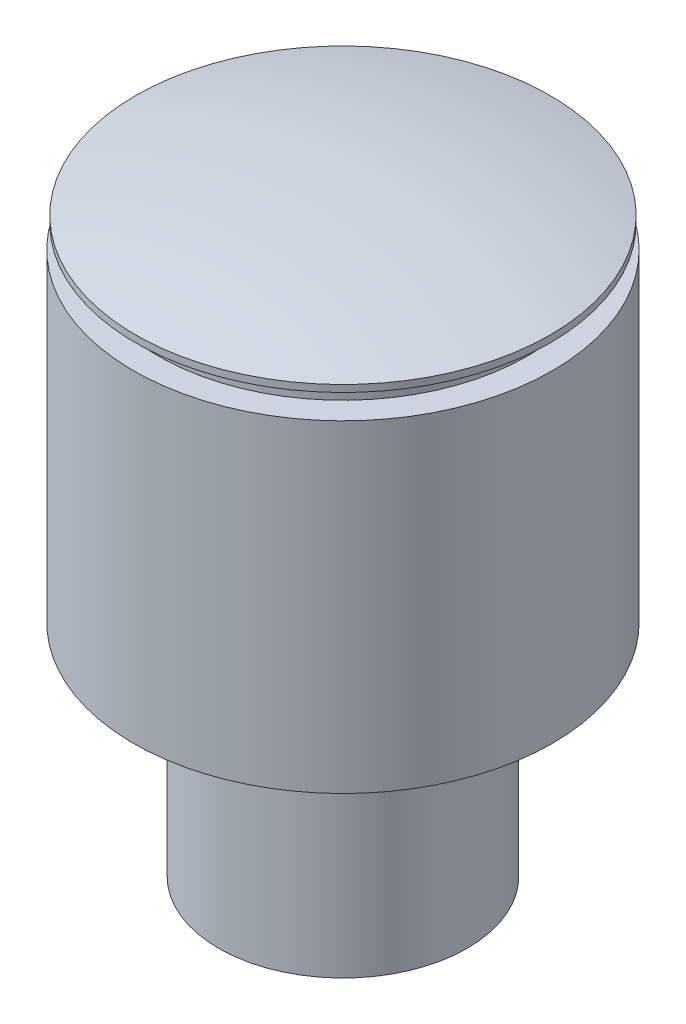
ISO-10303-21;
HEADER;
FILE_DESCRIPTION(('STEP AP214'),'2;1');
FILE_NAME('part.step','',(''),(''),'','','');
FILE_SCHEMA(('AUTOMOTIVE_DESIGN { 1 0 10303 214 1 1 1 1 }'));
ENDSEC;
DATA;
#1=APPLICATION_CONTEXT('core data for automotive mechanical design processes');
#2=APPLICATION_PROTOCOL_DEFINITION('international standard','automotive_design',2000,#1);
#3=PRODUCT_CONTEXT('',#1,'mechanical');
#4=PRODUCT('Part','Part','',(#3));
#5=PRODUCT_RELATED_PRODUCT_CATEGORY('part','',(#4));
#6=PRODUCT_DEFINITION_FORMATION('','',#4);
#7=PRODUCT_DEFINITION_CONTEXT('part definition',#1,'design');
#8=PRODUCT_DEFINITION('design','',#6,#7);
#9=PRODUCT_DEFINITION_SHAPE('','',#8);
#10=(LENGTH_UNIT() NAMED_UNIT(*) SI_UNIT(.MILLI.,.METRE.));
#11=(NAMED_UNIT(*) PLANE_ANGLE_UNIT() SI_UNIT($,.RADIAN.));
#12=(NAMED_UNIT(*) SI_UNIT($,.STERADIAN.) SOLID_ANGLE_UNIT());
#13=UNCERTAINTY_MEASURE_WITH_UNIT(LENGTH_MEASURE(1.E-05),#10,'distance_accuracy_value','');
#14=(GEOMETRIC_REPRESENTATION_CONTEXT(3) GLOBAL_UNCERTAINTY_ASSIGNED_CONTEXT((#13)) GLOBAL_UNIT_ASSIGNED_CONTEXT((#10,
#11,#12)) REPRESENTATION_CONTEXT('',''));
#15=CARTESIAN_POINT('',(0.,0.,0.));
#16=DIRECTION('',(0.,0.,1.));
#17=DIRECTION('',(1.,0.,0.));
#18=AXIS2_PLACEMENT_3D('',#15,#16,#17);
#19=CARTESIAN_POINT('',(0.,-9.99505011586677,0.));
#20=DIRECTION('',(0.,-1.,0.));
#21=DIRECTION('',(-1.,0.,0.));
#22=AXIS2_PLACEMENT_3D('',#19,#20,#21);
#23=SPHERICAL_SURFACE('',#22,36.);
#24=CARTESIAN_POINT('',(0.,24.8618,0.));
#25=DIRECTION('',(0.,-1.,0.));
#26=DIRECTION('',(1.,0.,0.));
#27=AXIS2_PLACEMENT_3D('',#24,#25,#26);
#28=CIRCLE('',#27,9.00000000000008);
#29=CARTESIAN_POINT('',(9.,24.8618,0.));
#30=VERTEX_POINT('',#29);
#31=EDGE_CURVE('E12',#30,#30,#28,.T.);
#32=ORIENTED_EDGE('',*,*,#31,.F.);
#33=EDGE_LOOP('',(#32));
#34=FACE_BOUND('',#33,.T.);
#35=ADVANCED_FACE('F42',(#34),#23,.T.);
#36=CARTESIAN_POINT('',(3.38618022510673E-12,-1000.,-1.11022302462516E-13));
#37=DIRECTION('',(0.,-1.,0.));
#38=DIRECTION('',(1.,0.,0.));
#39=AXIS2_PLACEMENT_3D('',#36,#37,#38);
#40=CYLINDRICAL_SURFACE('',#39,9.00000000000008);
#41=CARTESIAN_POINT('',(0.,24.5617999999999,0.));
#42=DIRECTION('',(0.,-1.,0.));
#43=DIRECTION('',(1.,0.,0.));
#44=AXIS2_PLACEMENT_3D('',#41,#42,#43);
#45=CIRCLE('',#44,9.00000000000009);
#46=CARTESIAN_POINT('',(9.,24.5617999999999,0.));
#47=VERTEX_POINT('',#46);
#48=EDGE_CURVE('E48',#47,#47,#45,.T.);
#49=CARTESIAN_POINT('',(9.,24.8618,0.));
#50=CARTESIAN_POINT('',(9.,24.858675,0.));
#51=CARTESIAN_POINT('',(9.,24.85555,0.));
#52=CARTESIAN_POINT('',(9.,24.8493,0.));
#53=CARTESIAN_POINT('',(9.,24.846175,0.));
#54=CARTESIAN_POINT('',(9.,24.8399250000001,0.));
#55=CARTESIAN_POINT('',(9.,24.8368,0.));
#56=CARTESIAN_POINT('',(9.,24.83055,0.));
#57=CARTESIAN_POINT('',(9.,24.8274250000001,0.));
#58=CARTESIAN_POINT('',(9.,24.8211750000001,0.));
#59=CARTESIAN_POINT('',(9.,24.8180500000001,0.));
#60=CARTESIAN_POINT('',(9.,24.8118,0.));
#61=CARTESIAN_POINT('',(9.,24.808675,0.));
#62=CARTESIAN_POINT('',(9.,24.802425,0.));
#63=CARTESIAN_POINT('',(9.,24.7993,0.));
#64=CARTESIAN_POINT('',(9.,24.7930500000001,0.));
#65=CARTESIAN_POINT('',(9.,24.789925,0.));
#66=CARTESIAN_POINT('',(9.,24.783675,0.));
#67=CARTESIAN_POINT('',(9.,24.7805499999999,0.));
#68=CARTESIAN_POINT('',(9.,24.7743,0.));
#69=CARTESIAN_POINT('',(9.,24.771175,0.));
#70=CARTESIAN_POINT('',(9.,24.764925,0.));
#71=CARTESIAN_POINT('',(9.,24.7618,0.));
#72=CARTESIAN_POINT('',(9.,24.7555499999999,0.));
#73=CARTESIAN_POINT('',(9.,24.7524249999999,0.));
#74=CARTESIAN_POINT('',(9.,24.7461749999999,0.));
#75=CARTESIAN_POINT('',(9.,24.74305,0.));
#76=CARTESIAN_POINT('',(9.,24.7368,0.));
#77=CARTESIAN_POINT('',(9.,24.7336749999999,0.));
#78=CARTESIAN_POINT('',(9.,24.727425,0.));
#79=CARTESIAN_POINT('',(9.,24.7243,0.));
#80=CARTESIAN_POINT('',(9.,24.71805,0.));
#81=CARTESIAN_POINT('',(9.,24.714925,0.));
#82=CARTESIAN_POINT('',(9.,24.7086749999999,0.));
#83=CARTESIAN_POINT('',(9.,24.7055499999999,0.));
#84=CARTESIAN_POINT('',(9.,24.6992999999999,0.));
#85=CARTESIAN_POINT('',(9.,24.696175,0.));
#86=CARTESIAN_POINT('',(9.,24.689925,0.));
#87=CARTESIAN_POINT('',(9.,24.6867999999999,0.));
#88=CARTESIAN_POINT('',(9.,24.68055,0.));
#89=CARTESIAN_POINT('',(9.,24.677425,0.));
#90=CARTESIAN_POINT('',(9.,24.671175,0.));
#91=CARTESIAN_POINT('',(9.,24.66805,0.));
#92=CARTESIAN_POINT('',(9.,24.6617999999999,0.));
#93=CARTESIAN_POINT('',(9.,24.6586749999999,0.));
#94=CARTESIAN_POINT('',(9.,24.6524249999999,0.));
#95=CARTESIAN_POINT('',(9.,24.6492999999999,0.));
#96=CARTESIAN_POINT('',(9.,24.64305,0.));
#97=CARTESIAN_POINT('',(9.,24.6399249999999,0.));
#98=CARTESIAN_POINT('',(9.,24.6336749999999,0.));
#99=CARTESIAN_POINT('',(9.,24.6305499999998,0.));
#100=CARTESIAN_POINT('',(9.,24.6242999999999,0.));
#101=CARTESIAN_POINT('',(9.,24.6211749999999,0.));
#102=CARTESIAN_POINT('',(9.,24.6149249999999,0.));
#103=CARTESIAN_POINT('',(9.,24.6117999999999,0.));
#104=CARTESIAN_POINT('',(9.,24.6055499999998,0.));
#105=CARTESIAN_POINT('',(9.,24.6024249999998,0.));
#106=CARTESIAN_POINT('',(9.,24.5961749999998,0.));
#107=CARTESIAN_POINT('',(9.,24.5930499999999,0.));
#108=CARTESIAN_POINT('',(9.,24.5867999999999,0.));
#109=CARTESIAN_POINT('',(9.,24.5836749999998,0.));
#110=CARTESIAN_POINT('',(9.,24.5774249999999,0.));
#111=CARTESIAN_POINT('',(9.,24.5742999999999,0.));
#112=CARTESIAN_POINT('',(9.,24.5680499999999,0.));
#113=CARTESIAN_POINT('',(9.,24.5649249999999,0.));
#114=CARTESIAN_POINT('',(9.,24.5617999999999,0.));
#115=B_SPLINE_CURVE_WITH_KNOTS('',3,(#49,#50,#51,#52,#53,#54,#55,#56,#57,#58,#59,#60,#61,#62,
#63,#64,#65,#66,#67,#68,#69,#70,#71,#72,#73,#74,#75,#76,#77,#78,#79,#80,#81,#82,#83,#84,#85,#86,
#87,#88,#89,#90,#91,#92,#93,#94,#95,#96,#97,#98,#99,#100,#101,#102,#103,#104,#105,#106,#107,
#108,#109,#110,#111,#112,#113,#114),.UNSPECIFIED.,.F.,.F.,(4,2,2,2,2,2,2,2,2,2,2,2,2,2,2,2,2,2,
2,2,2,2,2,2,2,2,2,2,2,2,2,2,4),(0.,0.00937500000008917,0.0187499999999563,0.0281250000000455,
0.0374999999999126,0.0468750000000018,0.0562500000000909,0.0656249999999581,0.0750000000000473,
0.0843750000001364,0.0937500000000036,0.103125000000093,0.112500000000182,0.121875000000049,
0.131250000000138,0.140625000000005,0.150000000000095,0.159375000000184,0.168750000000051,
0.17812500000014,0.187500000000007,0.196875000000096,0.206250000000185,0.215625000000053,
0.225000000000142,0.234375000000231,0.243750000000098,0.253125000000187,0.262500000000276,
0.271875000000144,0.281250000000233,0.2906250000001,0.300000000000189),.UNSPECIFIED.);
#116=EDGE_CURVE('BSEAM90',#30,#47,#115,.T.);
#117=ORIENTED_EDGE('',*,*,#31,.T.);
#118=ORIENTED_EDGE('',*,*,#48,.F.);
#119=ORIENTED_EDGE('',*,*,#116,.T.);
#120=ORIENTED_EDGE('',*,*,#116,.F.);
#121=EDGE_LOOP('',(#117,#119,#118,#120));
#122=FACE_BOUND('',#121,.T.);
#123=ADVANCED_FACE('F90',(#122),#40,.T.);
#124=CARTESIAN_POINT('',(-8.00000000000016,24.5617999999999,0.));
#125=DIRECTION('',(0.,-1.,0.));
#126=DIRECTION('',(1.,0.,0.));
#127=AXIS2_PLACEMENT_3D('',#124,#125,#126);
#128=PLANE('',#127);
#129=ORIENTED_EDGE('',*,*,#48,.T.);
#130=EDGE_LOOP('',(#129));
#131=FACE_BOUND('',#130,.T.);
#132=CARTESIAN_POINT('',(0.,24.5617999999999,0.));
#133=DIRECTION('',(0.,-1.,0.));
#134=DIRECTION('',(1.,0.,0.));
#135=AXIS2_PLACEMENT_3D('',#132,#133,#134);
#136=CIRCLE('',#135,8.00000000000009);
#137=CARTESIAN_POINT('',(8.,24.5617999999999,0.));
#138=VERTEX_POINT('',#137);
#139=EDGE_CURVE('E52',#138,#138,#136,.T.);
#140=ORIENTED_EDGE('',*,*,#139,.F.);
#141=EDGE_LOOP('',(#140));
#142=FACE_BOUND('',#141,.T.);
#143=ADVANCED_FACE('F95',(#131,#142),#128,.T.);
#144=CARTESIAN_POINT('',(3.38618022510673E-12,-1000.,-1.11022302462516E-13));
#145=DIRECTION('',(0.,-1.,0.));
#146=DIRECTION('',(1.,0.,0.));
#147=AXIS2_PLACEMENT_3D('',#144,#145,#146);
#148=CYLINDRICAL_SURFACE('',#147,8.00000000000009);
#149=CARTESIAN_POINT('',(0.,23.5617999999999,0.));
#150=DIRECTION('',(0.,-1.,0.));
#151=DIRECTION('',(1.,0.,0.));
#152=AXIS2_PLACEMENT_3D('',#149,#150,#151);
#153=CIRCLE('',#152,8.00000000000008);
#154=CARTESIAN_POINT('',(8.,23.5618,0.));
#155=VERTEX_POINT('',#154);
#156=EDGE_CURVE('E56',#155,#155,#153,.T.);
#157=CARTESIAN_POINT('',(8.,24.5617999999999,0.));
#158=CARTESIAN_POINT('',(8.,24.5513833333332,0.));
#159=CARTESIAN_POINT('',(8.,24.5409666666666,0.));
#160=CARTESIAN_POINT('',(8.,24.5201333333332,0.));
#161=CARTESIAN_POINT('',(8.,24.5097166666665,0.));
#162=CARTESIAN_POINT('',(8.,24.4888833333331,0.));
#163=CARTESIAN_POINT('',(8.,24.4784666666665,0.));
#164=CARTESIAN_POINT('',(8.,24.4576333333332,0.));
#165=CARTESIAN_POINT('',(8.,24.4472166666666,0.));
#166=CARTESIAN_POINT('',(8.,24.4263833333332,0.));
#167=CARTESIAN_POINT('',(8.,24.4159666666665,0.));
#168=CARTESIAN_POINT('',(8.,24.3951333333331,0.));
#169=CARTESIAN_POINT('',(8.,24.3847166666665,0.));
#170=CARTESIAN_POINT('',(8.,24.3638833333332,0.));
#171=CARTESIAN_POINT('',(8.,24.3534666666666,0.));
#172=CARTESIAN_POINT('',(8.,24.3326333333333,0.));
#173=CARTESIAN_POINT('',(8.,24.3222166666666,0.));
#174=CARTESIAN_POINT('',(8.,24.3013833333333,0.));
#175=CARTESIAN_POINT('',(8.,24.2909666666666,0.));
#176=CARTESIAN_POINT('',(8.,24.2701333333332,0.));
#177=CARTESIAN_POINT('',(8.,24.2597166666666,0.));
#178=CARTESIAN_POINT('',(8.,24.2388833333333,0.));
#179=CARTESIAN_POINT('',(8.,24.2284666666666,0.));
#180=CARTESIAN_POINT('',(8.,24.2076333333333,0.));
#181=CARTESIAN_POINT('',(8.,24.1972166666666,0.));
#182=CARTESIAN_POINT('',(8.,24.1763833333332,0.));
#183=CARTESIAN_POINT('',(8.,24.1659666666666,0.));
#184=CARTESIAN_POINT('',(8.,24.1451333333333,0.));
#185=CARTESIAN_POINT('',(8.,24.1347166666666,0.));
#186=CARTESIAN_POINT('',(8.,24.1138833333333,0.));
#187=CARTESIAN_POINT('',(8.,24.1034666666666,0.));
#188=CARTESIAN_POINT('',(8.,24.0826333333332,0.));
#189=CARTESIAN_POINT('',(8.,24.0722166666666,0.));
#190=CARTESIAN_POINT('',(8.,24.0513833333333,0.));
#191=CARTESIAN_POINT('',(8.,24.0409666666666,0.));
#192=CARTESIAN_POINT('',(8.,24.0201333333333,0.));
#193=CARTESIAN_POINT('',(8.,24.0097166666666,0.));
#194=CARTESIAN_POINT('',(8.,23.9888833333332,0.));
#195=CARTESIAN_POINT('',(8.,23.9784666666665,0.));
#196=CARTESIAN_POINT('',(8.,23.9576333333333,0.));
#197=CARTESIAN_POINT('',(8.,23.9472166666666,0.));
#198=CARTESIAN_POINT('',(8.,23.9263833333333,0.));
#199=CARTESIAN_POINT('',(8.,23.9159666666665,0.));
#200=CARTESIAN_POINT('',(8.,23.8951333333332,0.));
#201=CARTESIAN_POINT('',(8.,23.8847166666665,0.));
#202=CARTESIAN_POINT('',(8.,23.8638833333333,0.));
#203=CARTESIAN_POINT('',(8.,23.8534666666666,0.));
#204=CARTESIAN_POINT('',(8.,23.8326333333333,0.));
#205=CARTESIAN_POINT('',(8.,23.8222166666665,0.));
#206=CARTESIAN_POINT('',(8.,23.8013833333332,0.));
#207=CARTESIAN_POINT('',(8.,23.7909666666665,0.));
#208=CARTESIAN_POINT('',(8.,23.7701333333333,0.));
#209=CARTESIAN_POINT('',(8.,23.7597166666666,0.));
#210=CARTESIAN_POINT('',(8.,23.7388833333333,0.));
#211=CARTESIAN_POINT('',(8.,23.7284666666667,0.));
#212=CARTESIAN_POINT('',(8.,23.7076333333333,0.));
#213=CARTESIAN_POINT('',(8.,23.6972166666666,0.));
#214=CARTESIAN_POINT('',(8.,23.6763833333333,0.));
#215=CARTESIAN_POINT('',(8.,23.6659666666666,0.));
#216=CARTESIAN_POINT('',(8.,23.6451333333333,0.));
#217=CARTESIAN_POINT('',(8.,23.6347166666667,0.));
#218=CARTESIAN_POINT('',(8.,23.6138833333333,0.));
#219=CARTESIAN_POINT('',(8.,23.6034666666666,0.));
#220=CARTESIAN_POINT('',(8.,23.5826333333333,0.));
#221=CARTESIAN_POINT('',(8.,23.5722166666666,0.));
#222=CARTESIAN_POINT('',(8.,23.5618,0.));
#223=B_SPLINE_CURVE_WITH_KNOTS('',3,(#157,#158,#159,#160,#161,#162,#163,#164,#165,#166,#167,
#168,#169,#170,#171,#172,#173,#174,#175,#176,#177,#178,#179,#180,#181,#182,#183,#184,#185,#186,
#187,#188,#189,#190,#191,#192,#193,#194,#195,#196,#197,#198,#199,#200,#201,#202,#203,#204,#205,
#206,#207,#208,#209,#210,#211,#212,#213,#214,#215,#216,#217,#218,#219,#220,#221,#222),
.UNSPECIFIED.,.F.,.F.,(4,2,2,2,2,2,2,2,2,2,2,2,2,2,2,2,2,2,2,2,2,2,2,2,2,2,2,2,2,2,2,2,4),(0.,
0.0312499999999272,0.0625000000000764,0.0937500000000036,0.124999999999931,0.15625000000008,
0.187500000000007,0.218749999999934,0.249999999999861,0.281250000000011,0.312499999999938,
0.343749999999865,0.375000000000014,0.406249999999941,0.437499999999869,0.468750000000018,
0.499999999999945,0.531249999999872,0.562500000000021,0.593749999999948,0.624999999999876,
0.656250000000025,0.687499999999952,0.718749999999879,0.750000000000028,0.781249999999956,
0.812499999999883,0.84374999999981,0.874999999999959,0.906249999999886,0.937499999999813,
0.968749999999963,0.99999999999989),.UNSPECIFIED.);
#224=EDGE_CURVE('BSEAM99',#138,#155,#223,.T.);
#225=ORIENTED_EDGE('',*,*,#139,.T.);
#226=ORIENTED_EDGE('',*,*,#156,.F.);
#227=ORIENTED_EDGE('',*,*,#224,.T.);
#228=ORIENTED_EDGE('',*,*,#224,.F.);
#229=EDGE_LOOP('',(#225,#227,#226,#228));
#230=FACE_BOUND('',#229,.T.);
#231=ADVANCED_FACE('F99',(#230),#148,.T.);
#232=CARTESIAN_POINT('',(-8.00000000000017,23.5617999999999,0.));
#233=DIRECTION('',(0.,1.,0.));
#234=DIRECTION('',(-1.,0.,0.));
#235=AXIS2_PLACEMENT_3D('',#232,#233,#234);
#236=PLANE('',#235);
#237=ORIENTED_EDGE('',*,*,#156,.T.);
#238=EDGE_LOOP('',(#237));
#239=FACE_BOUND('',#238,.T.);
#240=CARTESIAN_POINT('',(0.,23.5617999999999,0.));
#241=DIRECTION('',(0.,-1.,0.));
#242=DIRECTION('',(1.,0.,0.));
#243=AXIS2_PLACEMENT_3D('',#240,#241,#242);
#244=CIRCLE('',#243,9.09243130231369);
#245=CARTESIAN_POINT('',(9.09243130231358,23.5618,0.));
#246=VERTEX_POINT('',#245);
#247=EDGE_CURVE('E61',#246,#246,#244,.T.);
#248=ORIENTED_EDGE('',*,*,#247,.F.);
#249=EDGE_LOOP('',(#248));
#250=FACE_BOUND('',#249,.T.);
#251=ADVANCED_FACE('F105',(#239,#250),#236,.T.);
#252=CARTESIAN_POINT('',(3.38618022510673E-12,-1000.,-1.11022302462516E-13));
#253=DIRECTION('',(0.,-1.,0.));
#254=DIRECTION('',(1.,0.,0.));
#255=AXIS2_PLACEMENT_3D('',#252,#253,#254);
#256=CYLINDRICAL_SURFACE('',#255,9.09243130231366);
#257=CARTESIAN_POINT('',(0.,9.55039999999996,0.));
#258=DIRECTION('',(0.,-1.,0.));
#259=DIRECTION('',(1.,0.,0.));
#260=AXIS2_PLACEMENT_3D('',#257,#258,#259);
#261=CIRCLE('',#260,9.09243130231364);
#262=CARTESIAN_POINT('',(9.09243130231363,9.55040000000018,0.));
#263=VERTEX_POINT('',#262);
#264=EDGE_CURVE('E64',#263,#263,#261,.T.);
#265=CARTESIAN_POINT('',(9.09243130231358,23.5618,0.));
#266=CARTESIAN_POINT('',(9.09243130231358,23.4158479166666,0.));
#267=CARTESIAN_POINT('',(9.09243130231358,23.2698958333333,0.));
#268=CARTESIAN_POINT('',(9.09243130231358,22.9779916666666,0.));
#269=CARTESIAN_POINT('',(9.09243130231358,22.8320395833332,0.));
#270=CARTESIAN_POINT('',(9.09243130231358,22.5401354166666,0.));
#271=CARTESIAN_POINT('',(9.09243130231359,22.3941833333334,0.));
#272=CARTESIAN_POINT('',(9.09243130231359,22.1022791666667,0.));
#273=CARTESIAN_POINT('',(9.09243130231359,21.9563270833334,0.));
#274=CARTESIAN_POINT('',(9.09243130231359,21.6644229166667,0.));
#275=CARTESIAN_POINT('',(9.09243130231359,21.5184708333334,0.));
#276=CARTESIAN_POINT('',(9.09243130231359,21.2265666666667,0.));
#277=CARTESIAN_POINT('',(9.09243130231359,21.0806145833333,0.));
#278=CARTESIAN_POINT('',(9.09243130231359,20.7887104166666,0.));
#279=CARTESIAN_POINT('',(9.09243130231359,20.6427583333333,0.));
#280=CARTESIAN_POINT('',(9.09243130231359,20.3508541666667,0.));
#281=CARTESIAN_POINT('',(9.09243130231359,20.2049020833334,0.));
#282=CARTESIAN_POINT('',(9.09243130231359,19.9129979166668,0.));
#283=CARTESIAN_POINT('',(9.09243130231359,19.7670458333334,0.));
#284=CARTESIAN_POINT('',(9.09243130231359,19.4751416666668,0.));
#285=CARTESIAN_POINT('',(9.0924313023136,19.3291895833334,0.));
#286=CARTESIAN_POINT('',(9.0924313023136,19.0372854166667,0.));
#287=CARTESIAN_POINT('',(9.0924313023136,18.8913333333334,0.));
#288=CARTESIAN_POINT('',(9.0924313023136,18.5994291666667,0.));
#289=CARTESIAN_POINT('',(9.0924313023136,18.4534770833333,0.));
#290=CARTESIAN_POINT('',(9.0924313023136,18.1615729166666,0.));
#291=CARTESIAN_POINT('',(9.0924313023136,18.0156208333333,0.));
#292=CARTESIAN_POINT('',(9.0924313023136,17.7237166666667,0.));
#293=CARTESIAN_POINT('',(9.0924313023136,17.5777645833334,0.));
#294=CARTESIAN_POINT('',(9.0924313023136,17.2858604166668,0.));
#295=CARTESIAN_POINT('',(9.0924313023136,17.1399083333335,0.));
#296=CARTESIAN_POINT('',(9.0924313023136,16.8480041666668,0.));
#297=CARTESIAN_POINT('',(9.0924313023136,16.7020520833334,0.));
#298=CARTESIAN_POINT('',(9.0924313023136,16.4101479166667,0.));
#299=CARTESIAN_POINT('',(9.09243130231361,16.2641958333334,0.));
#300=CARTESIAN_POINT('',(9.09243130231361,15.9722916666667,0.));
#301=CARTESIAN_POINT('',(9.09243130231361,15.8263395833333,0.));
#302=CARTESIAN_POINT('',(9.09243130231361,15.5344354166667,0.));
#303=CARTESIAN_POINT('',(9.09243130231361,15.3884833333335,0.));
#304=CARTESIAN_POINT('',(9.09243130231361,15.0965791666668,0.));
#305=CARTESIAN_POINT('',(9.09243130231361,14.9506270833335,0.));
#306=CARTESIAN_POINT('',(9.09243130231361,14.6587229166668,0.));
#307=CARTESIAN_POINT('',(9.09243130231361,14.5127708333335,0.));
#308=CARTESIAN_POINT('',(9.09243130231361,14.2208666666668,0.));
#309=CARTESIAN_POINT('',(9.09243130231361,14.0749145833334,0.));
#310=CARTESIAN_POINT('',(9.09243130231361,13.7830104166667,0.));
#311=CARTESIAN_POINT('',(9.09243130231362,13.6370583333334,0.));
#312=CARTESIAN_POINT('',(9.09243130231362,13.3451541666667,0.));
#313=CARTESIAN_POINT('',(9.09243130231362,13.1992020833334,0.));
#314=CARTESIAN_POINT('',(9.09243130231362,12.9072979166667,0.));
#315=CARTESIAN_POINT('',(9.09243130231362,12.7613458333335,0.));
#316=CARTESIAN_POINT('',(9.09243130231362,12.4694416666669,0.));
#317=CARTESIAN_POINT('',(9.09243130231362,12.3234895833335,0.));
#318=CARTESIAN_POINT('',(9.09243130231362,12.0315854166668,0.));
#319=CARTESIAN_POINT('',(9.09243130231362,11.8856333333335,0.));
#320=CARTESIAN_POINT('',(9.09243130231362,11.5937291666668,0.));
#321=CARTESIAN_POINT('',(9.09243130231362,11.4477770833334,0.));
#322=CARTESIAN_POINT('',(9.09243130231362,11.1558729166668,0.));
#323=CARTESIAN_POINT('',(9.09243130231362,11.0099208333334,0.));
#324=CARTESIAN_POINT('',(9.09243130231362,10.7180166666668,0.));
#325=CARTESIAN_POINT('',(9.09243130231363,10.5720645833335,0.));
#326=CARTESIAN_POINT('',(9.09243130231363,10.2801604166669,0.));
#327=CARTESIAN_POINT('',(9.09243130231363,10.1342083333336,0.));
#328=CARTESIAN_POINT('',(9.09243130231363,9.84230416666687,0.));
#329=CARTESIAN_POINT('',(9.09243130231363,9.69635208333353,0.));
#330=CARTESIAN_POINT('',(9.09243130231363,9.55040000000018,0.));
#331=B_SPLINE_CURVE_WITH_KNOTS('',3,(#265,#266,#267,#268,#269,#270,#271,#272,#273,#274,#275,
#276,#277,#278,#279,#280,#281,#282,#283,#284,#285,#286,#287,#288,#289,#290,#291,#292,#293,#294,
#295,#296,#297,#298,#299,#300,#301,#302,#303,#304,#305,#306,#307,#308,#309,#310,#311,#312,#313,
#314,#315,#316,#317,#318,#319,#320,#321,#322,#323,#324,#325,#326,#327,#328,#329,#330),
.UNSPECIFIED.,.F.,.F.,(4,2,2,2,2,2,2,2,2,2,2,2,2,2,2,2,2,2,2,2,2,2,2,2,2,2,2,2,2,2,2,2,4),(0.,
0.437856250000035,0.87571250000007,1.31356874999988,1.75142499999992,2.18928124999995,
2.62713749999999,3.06499375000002,3.50284999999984,3.94070624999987,4.37856249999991,
4.81641874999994,5.25427499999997,5.69213125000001,6.12998749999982,6.56784374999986,
7.00569999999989,7.44355624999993,7.88141249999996,8.31926874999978,8.75712499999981,
9.19498124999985,9.63283749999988,10.0706937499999,10.5085499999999,10.9464062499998,
11.3842624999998,11.8221187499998,12.2599749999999,12.6978312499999,13.1356874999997,
13.5735437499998,14.0113999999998),.UNSPECIFIED.);
#332=EDGE_CURVE('BSEAM86',#246,#263,#331,.T.);
#333=ORIENTED_EDGE('',*,*,#247,.T.);
#334=ORIENTED_EDGE('',*,*,#264,.F.);
#335=ORIENTED_EDGE('',*,*,#332,.T.);
#336=ORIENTED_EDGE('',*,*,#332,.F.);
#337=EDGE_LOOP('',(#333,#335,#334,#336));
#338=FACE_BOUND('',#337,.T.);
#339=ADVANCED_FACE('F86',(#338),#256,.T.);
#340=CARTESIAN_POINT('',(-5.39750000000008,9.55039999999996,0.));
#341=DIRECTION('',(0.,-1.,0.));
#342=DIRECTION('',(1.,0.,0.));
#343=AXIS2_PLACEMENT_3D('',#340,#341,#342);
#344=PLANE('',#343);
#345=ORIENTED_EDGE('',*,*,#264,.T.);
#346=EDGE_LOOP('',(#345));
#347=FACE_BOUND('',#346,.T.);
#348=CARTESIAN_POINT('',(0.,9.55039999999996,0.));
#349=DIRECTION('',(0.,-1.,0.));
#350=DIRECTION('',(1.,0.,0.));
#351=AXIS2_PLACEMENT_3D('',#348,#349,#350);
#352=CIRCLE('',#351,5.39750000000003);
#353=CARTESIAN_POINT('',(5.39749999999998,9.55040000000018,0.));
#354=VERTEX_POINT('',#353);
#355=EDGE_CURVE('E67',#354,#354,#352,.T.);
#356=ORIENTED_EDGE('',*,*,#355,.F.);
#357=EDGE_LOOP('',(#356));
#358=FACE_BOUND('',#357,.T.);
#359=ADVANCED_FACE('F78',(#347,#358),#344,.T.);
#360=CARTESIAN_POINT('',(3.38618022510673E-12,-1000.,-1.11022302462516E-13));
#361=DIRECTION('',(0.,-1.,0.));
#362=DIRECTION('',(1.,0.,0.));
#363=AXIS2_PLACEMENT_3D('',#360,#361,#362);
#364=CYLINDRICAL_SURFACE('',#363,5.39750000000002);
#365=CARTESIAN_POINT('',(0.,0.,0.));
#366=DIRECTION('',(0.,-1.,0.));
#367=DIRECTION('',(1.,0.,0.));
#368=AXIS2_PLACEMENT_3D('',#365,#366,#367);
#369=CIRCLE('',#368,5.3975);
#370=CARTESIAN_POINT('',(5.39750000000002,0.,0.));
#371=VERTEX_POINT('',#370);
#372=EDGE_CURVE('E70',#371,#371,#369,.T.);
#373=CARTESIAN_POINT('',(5.39749999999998,9.55040000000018,0.));
#374=CARTESIAN_POINT('',(5.39749999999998,9.45091666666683,0.));
#375=CARTESIAN_POINT('',(5.39749999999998,9.35143333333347,0.));
#376=CARTESIAN_POINT('',(5.39749999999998,9.15246666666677,0.));
#377=CARTESIAN_POINT('',(5.39749999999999,9.05298333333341,0.));
#378=CARTESIAN_POINT('',(5.39749999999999,8.85401666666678,0.));
#379=CARTESIAN_POINT('',(5.39749999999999,8.7545333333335,0.));
#380=CARTESIAN_POINT('',(5.39749999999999,8.55556666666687,0.));
#381=CARTESIAN_POINT('',(5.39749999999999,8.45608333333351,0.));
#382=CARTESIAN_POINT('',(5.39749999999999,8.25711666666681,0.));
#383=CARTESIAN_POINT('',(5.39749999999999,8.15763333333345,0.));
#384=CARTESIAN_POINT('',(5.39749999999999,7.95866666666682,0.));
#385=CARTESIAN_POINT('',(5.39749999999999,7.85918333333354,0.));
#386=CARTESIAN_POINT('',(5.39749999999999,7.6602166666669,0.));
#387=CARTESIAN_POINT('',(5.39749999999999,7.56073333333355,0.));
#388=CARTESIAN_POINT('',(5.39749999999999,7.36176666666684,0.));
#389=CARTESIAN_POINT('',(5.39749999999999,7.26228333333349,0.));
#390=CARTESIAN_POINT('',(5.39749999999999,7.06331666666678,0.));
#391=CARTESIAN_POINT('',(5.39749999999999,6.96383333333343,0.));
#392=CARTESIAN_POINT('',(5.39749999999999,6.76486666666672,0.));
#393=CARTESIAN_POINT('',(5.39749999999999,6.66538333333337,0.));
#394=CARTESIAN_POINT('',(5.39749999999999,6.46641666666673,0.));
#395=CARTESIAN_POINT('',(5.39749999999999,6.36693333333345,0.));
#396=CARTESIAN_POINT('',(5.3975,6.16796666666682,0.));
#397=CARTESIAN_POINT('',(5.3975,6.06848333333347,0.));
#398=CARTESIAN_POINT('',(5.3975,5.86951666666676,0.));
#399=CARTESIAN_POINT('',(5.3975,5.77003333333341,0.));
#400=CARTESIAN_POINT('',(5.3975,5.57106666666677,0.));
#401=CARTESIAN_POINT('',(5.3975,5.47158333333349,0.));
#402=CARTESIAN_POINT('',(5.3975,5.27261666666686,0.));
#403=CARTESIAN_POINT('',(5.3975,5.17313333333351,0.));
#404=CARTESIAN_POINT('',(5.3975,4.9741666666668,0.));
#405=CARTESIAN_POINT('',(5.3975,4.87468333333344,0.));
#406=CARTESIAN_POINT('',(5.3975,4.67571666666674,0.));
#407=CARTESIAN_POINT('',(5.3975,4.57623333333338,0.));
#408=CARTESIAN_POINT('',(5.3975,4.37726666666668,0.));
#409=CARTESIAN_POINT('',(5.3975,4.27778333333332,0.));
#410=CARTESIAN_POINT('',(5.3975,4.07881666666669,0.));
#411=CARTESIAN_POINT('',(5.3975,3.97933333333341,0.));
#412=CARTESIAN_POINT('',(5.3975,3.78036666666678,0.));
#413=CARTESIAN_POINT('',(5.3975,3.68088333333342,0.));
#414=CARTESIAN_POINT('',(5.3975,3.48191666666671,0.));
#415=CARTESIAN_POINT('',(5.3975,3.38243333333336,0.));
#416=CARTESIAN_POINT('',(5.3975,3.18346666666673,0.));
#417=CARTESIAN_POINT('',(5.3975,3.08398333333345,0.));
#418=CARTESIAN_POINT('',(5.39750000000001,2.88501666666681,0.));
#419=CARTESIAN_POINT('',(5.39750000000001,2.78553333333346,0.));
#420=CARTESIAN_POINT('',(5.39750000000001,2.58656666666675,0.));
#421=CARTESIAN_POINT('',(5.39750000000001,2.4870833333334,0.));
#422=CARTESIAN_POINT('',(5.39750000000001,2.28811666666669,0.));
#423=CARTESIAN_POINT('',(5.39750000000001,2.18863333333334,0.));
#424=CARTESIAN_POINT('',(5.39750000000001,1.98966666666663,0.));
#425=CARTESIAN_POINT('',(5.39750000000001,1.89018333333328,0.));
#426=CARTESIAN_POINT('',(5.39750000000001,1.69121666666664,0.));
#427=CARTESIAN_POINT('',(5.39750000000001,1.59173333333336,0.));
#428=CARTESIAN_POINT('',(5.39750000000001,1.39276666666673,0.));
#429=CARTESIAN_POINT('',(5.39750000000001,1.29328333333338,0.));
#430=CARTESIAN_POINT('',(5.39750000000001,1.09431666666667,0.));
#431=CARTESIAN_POINT('',(5.39750000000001,0.994833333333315,0.));
#432=CARTESIAN_POINT('',(5.39750000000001,0.795866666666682,0.));
#433=CARTESIAN_POINT('',(5.39750000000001,0.696383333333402,0.));
#434=CARTESIAN_POINT('',(5.39750000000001,0.497416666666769,0.));
#435=CARTESIAN_POINT('',(5.39750000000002,0.397933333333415,0.));
#436=CARTESIAN_POINT('',(5.39750000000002,0.198966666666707,0.));
#437=CARTESIAN_POINT('',(5.39750000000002,0.0994833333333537,0.));
#438=CARTESIAN_POINT('',(5.39750000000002,0.,0.));
#439=B_SPLINE_CURVE_WITH_KNOTS('',3,(#373,#374,#375,#376,#377,#378,#379,#380,#381,#382,#383,
#384,#385,#386,#387,#388,#389,#390,#391,#392,#393,#394,#395,#396,#397,#398,#399,#400,#401,#402,
#403,#404,#405,#406,#407,#408,#409,#410,#411,#412,#413,#414,#415,#416,#417,#418,#419,#420,#421,
#422,#423,#424,#425,#426,#427,#428,#429,#430,#431,#432,#433,#434,#435,#436,#437,#438),
.UNSPECIFIED.,.F.,.F.,(4,2,2,2,2,2,2,2,2,2,2,2,2,2,2,2,2,2,2,2,2,2,2,2,2,2,2,2,2,2,2,2,4),(0.,
0.298450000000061,0.596900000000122,0.895349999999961,1.19380000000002,1.49225000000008,
1.79069999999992,2.08914999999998,2.38760000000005,2.68605000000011,2.98450000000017,
3.28295000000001,3.58140000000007,3.87985000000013,4.17829999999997,4.47675000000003,
4.77520000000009,5.07365000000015,5.37210000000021,5.67055000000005,5.96900000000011,
6.26745000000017,6.56590000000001,6.86435000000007,7.16280000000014,7.4612500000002,
7.75970000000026,8.0581500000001,8.35660000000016,8.65505000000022,8.95350000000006,
9.25195000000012,9.55040000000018),.UNSPECIFIED.);
#440=EDGE_CURVE('BSEAM76',#354,#371,#439,.T.);
#441=ORIENTED_EDGE('',*,*,#355,.T.);
#442=ORIENTED_EDGE('',*,*,#372,.F.);
#443=ORIENTED_EDGE('',*,*,#440,.T.);
#444=ORIENTED_EDGE('',*,*,#440,.F.);
#445=EDGE_LOOP('',(#441,#443,#442,#444));
#446=FACE_BOUND('',#445,.T.);
#447=ADVANCED_FACE('F76',(#446),#364,.T.);
#448=CARTESIAN_POINT('',(0.,0.,0.));
#449=DIRECTION('',(0.,-1.,0.));
#450=DIRECTION('',(1.,0.,0.));
#451=AXIS2_PLACEMENT_3D('',#448,#449,#450);
#452=PLANE('',#451);
#453=ORIENTED_EDGE('',*,*,#372,.T.);
#454=EDGE_LOOP('',(#453));
#455=FACE_BOUND('',#454,.T.);
#456=ADVANCED_FACE('F74',(#455),#452,.T.);
#457=CLOSED_SHELL('',(#35,#123,#143,#231,#251,#339,#359,#447,#456));
#458=MANIFOLD_SOLID_BREP('B2',#457);
#459=ADVANCED_BREP_SHAPE_REPRESENTATION('',(#18,#458),#14);
#460=SHAPE_DEFINITION_REPRESENTATION(#9,#459);
ENDSEC;
END-ISO-10303-21;
